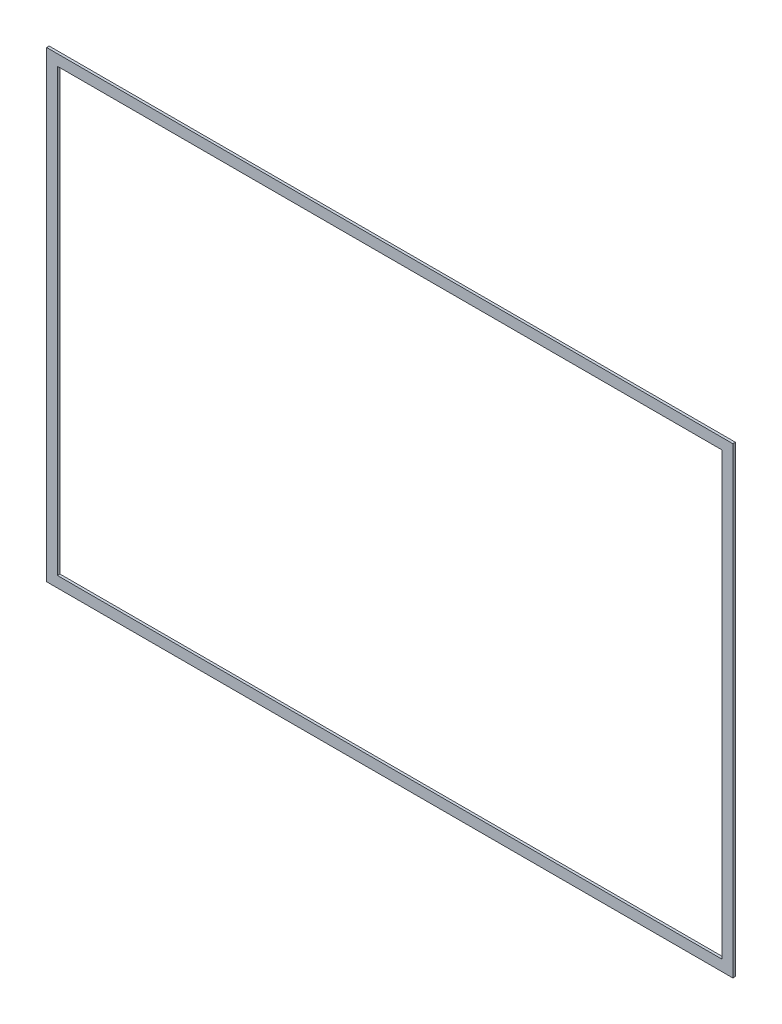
from build123d import *

# Parameters (mm, degrees)
CROQUIS1_W              = 947
CROQUIS1_H              = 638.5
CROQUIS1_W_2            = 917
CROQUIS1_H_2            = 608.5
SALIENTE_EXTRUIR1_DEPTH = 3.5


with BuildPart() as part:
    # Croquis1 → Saliente-Extruir1 (new body)
    with BuildSketch(Plane.XY):
        with Locations((473.5, 319.25)):
            Rectangle(CROQUIS1_W, CROQUIS1_H)
        with Locations((473.5, 319.25)):
            Rectangle(CROQUIS1_W_2, CROQUIS1_H_2, mode=Mode.SUBTRACT)
    extrude(amount=SALIENTE_EXTRUIR1_DEPTH)


solid = part.part
